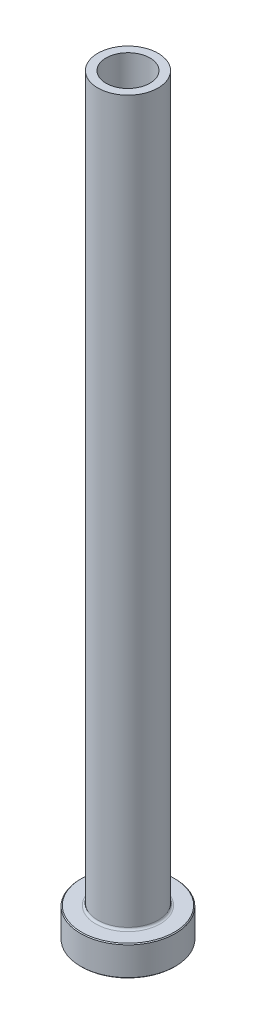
ISO-10303-21;
HEADER;
FILE_DESCRIPTION(('STEP AP214'),'2;1');
FILE_NAME('part.step','',(''),(''),'','','');
FILE_SCHEMA(('AUTOMOTIVE_DESIGN { 1 0 10303 214 1 1 1 1 }'));
ENDSEC;
DATA;
#1=APPLICATION_CONTEXT('core data for automotive mechanical design processes');
#2=APPLICATION_PROTOCOL_DEFINITION('international standard','automotive_design',2000,#1);
#3=PRODUCT_CONTEXT('',#1,'mechanical');
#4=PRODUCT('Part','Part','',(#3));
#5=PRODUCT_RELATED_PRODUCT_CATEGORY('part','',(#4));
#6=PRODUCT_DEFINITION_FORMATION('','',#4);
#7=PRODUCT_DEFINITION_CONTEXT('part definition',#1,'design');
#8=PRODUCT_DEFINITION('design','',#6,#7);
#9=PRODUCT_DEFINITION_SHAPE('','',#8);
#10=(LENGTH_UNIT() NAMED_UNIT(*) SI_UNIT(.MILLI.,.METRE.));
#11=(NAMED_UNIT(*) PLANE_ANGLE_UNIT() SI_UNIT($,.RADIAN.));
#12=(NAMED_UNIT(*) SI_UNIT($,.STERADIAN.) SOLID_ANGLE_UNIT());
#13=UNCERTAINTY_MEASURE_WITH_UNIT(LENGTH_MEASURE(1.E-05),#10,'distance_accuracy_value','');
#14=(GEOMETRIC_REPRESENTATION_CONTEXT(3) GLOBAL_UNCERTAINTY_ASSIGNED_CONTEXT((#13)) GLOBAL_UNIT_ASSIGNED_CONTEXT((#10,
#11,#12)) REPRESENTATION_CONTEXT('',''));
#15=CARTESIAN_POINT('',(0.,0.,0.));
#16=DIRECTION('',(0.,0.,1.));
#17=DIRECTION('',(1.,0.,0.));
#18=AXIS2_PLACEMENT_3D('',#15,#16,#17);
#19=CARTESIAN_POINT('',(0.,92.1876809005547,0.));
#20=DIRECTION('',(0.,1.,0.));
#21=DIRECTION('',(0.,0.,1.));
#22=AXIS2_PLACEMENT_3D('',#19,#20,#21);
#23=CYLINDRICAL_SURFACE('',#22,5.1);
#24=CARTESIAN_POINT('',(0.,175.,0.));
#25=DIRECTION('',(0.,1.,0.));
#26=DIRECTION('',(0.,0.,1.));
#27=AXIS2_PLACEMENT_3D('',#24,#25,#26);
#28=CIRCLE('',#27,5.1);
#29=CARTESIAN_POINT('',(0.,175.,5.1));
#30=VERTEX_POINT('',#29);
#31=EDGE_CURVE('E62',#30,#30,#28,.T.);
#32=ORIENTED_EDGE('',*,*,#31,.T.);
#33=EDGE_LOOP('',(#32));
#34=FACE_BOUND('',#33,.T.);
#35=CARTESIAN_POINT('',(0.,120.,0.));
#36=DIRECTION('',(0.,1.,0.));
#37=DIRECTION('',(0.,0.,1.));
#38=AXIS2_PLACEMENT_3D('',#35,#36,#37);
#39=CIRCLE('',#38,5.1);
#40=CARTESIAN_POINT('',(0.,120.,5.1));
#41=VERTEX_POINT('',#40);
#42=EDGE_CURVE('E71',#41,#41,#39,.T.);
#43=ORIENTED_EDGE('',*,*,#42,.F.);
#44=EDGE_LOOP('',(#43));
#45=FACE_BOUND('',#44,.T.);
#46=ADVANCED_FACE('F30',(#34,#45),#23,.F.);
#47=CARTESIAN_POINT('',(-5.1,175.,0.));
#48=DIRECTION('',(0.,1.,0.));
#49=DIRECTION('',(0.,0.,1.));
#50=AXIS2_PLACEMENT_3D('',#47,#48,#49);
#51=PLANE('',#50);
#52=CARTESIAN_POINT('',(0.,175.,0.));
#53=DIRECTION('',(0.,1.,0.));
#54=DIRECTION('',(0.,0.,1.));
#55=AXIS2_PLACEMENT_3D('',#52,#53,#54);
#56=CIRCLE('',#55,7.00000000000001);
#57=CARTESIAN_POINT('',(0.,175.,7.00000000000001));
#58=VERTEX_POINT('',#57);
#59=EDGE_CURVE('E65',#58,#58,#56,.T.);
#60=ORIENTED_EDGE('',*,*,#59,.T.);
#61=EDGE_LOOP('',(#60));
#62=FACE_BOUND('',#61,.T.);
#63=ORIENTED_EDGE('',*,*,#31,.F.);
#64=EDGE_LOOP('',(#63));
#65=FACE_BOUND('',#64,.T.);
#66=ADVANCED_FACE('F79',(#62,#65),#51,.T.);
#67=CARTESIAN_POINT('',(0.,92.1876809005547,0.));
#68=DIRECTION('',(0.,1.,0.));
#69=DIRECTION('',(0.,0.,1.));
#70=AXIS2_PLACEMENT_3D('',#67,#68,#69);
#71=CYLINDRICAL_SURFACE('',#70,7.);
#72=CARTESIAN_POINT('',(0.,7.50000000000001,0.));
#73=DIRECTION('',(0.,1.,0.));
#74=DIRECTION('',(0.,0.,1.));
#75=AXIS2_PLACEMENT_3D('',#72,#73,#74);
#76=CIRCLE('',#75,7.);
#77=CARTESIAN_POINT('',(0.,7.50000000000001,7.));
#78=VERTEX_POINT('',#77);
#79=EDGE_CURVE('E59',#78,#78,#76,.T.);
#80=ORIENTED_EDGE('',*,*,#79,.T.);
#81=EDGE_LOOP('',(#80));
#82=FACE_BOUND('',#81,.T.);
#83=ORIENTED_EDGE('',*,*,#59,.F.);
#84=EDGE_LOOP('',(#83));
#85=FACE_BOUND('',#84,.T.);
#86=ADVANCED_FACE('F85',(#82,#85),#71,.T.);
#87=CARTESIAN_POINT('',(-6.99999999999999,7.,0.));
#88=DIRECTION('',(0.,1.,0.));
#89=DIRECTION('',(0.,0.,1.));
#90=AXIS2_PLACEMENT_3D('',#87,#88,#89);
#91=PLANE('',#90);
#92=CARTESIAN_POINT('',(0.,7.,0.));
#93=DIRECTION('',(0.,1.,0.));
#94=DIRECTION('',(0.,0.,1.));
#95=AXIS2_PLACEMENT_3D('',#92,#93,#94);
#96=CIRCLE('',#95,10.8);
#97=CARTESIAN_POINT('',(0.,7.,10.8));
#98=VERTEX_POINT('',#97);
#99=EDGE_CURVE('E53',#98,#98,#96,.T.);
#100=ORIENTED_EDGE('',*,*,#99,.T.);
#101=EDGE_LOOP('',(#100));
#102=FACE_BOUND('',#101,.T.);
#103=CARTESIAN_POINT('',(0.,7.,0.));
#104=DIRECTION('',(0.,1.,0.));
#105=DIRECTION('',(0.,0.,1.));
#106=AXIS2_PLACEMENT_3D('',#103,#104,#105);
#107=CIRCLE('',#106,7.5);
#108=CARTESIAN_POINT('',(0.,7.,7.5));
#109=VERTEX_POINT('',#108);
#110=EDGE_CURVE('E56',#109,#109,#107,.F.);
#111=ORIENTED_EDGE('',*,*,#110,.T.);
#112=EDGE_LOOP('',(#111));
#113=FACE_BOUND('',#112,.T.);
#114=ADVANCED_FACE('F111',(#102,#113),#91,.T.);
#115=CARTESIAN_POINT('',(0.,92.1876809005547,0.));
#116=DIRECTION('',(0.,1.,0.));
#117=DIRECTION('',(0.,0.,1.));
#118=AXIS2_PLACEMENT_3D('',#115,#116,#117);
#119=CYLINDRICAL_SURFACE('',#118,11.);
#120=CARTESIAN_POINT('',(0.,6.8,0.));
#121=DIRECTION('',(0.,1.,0.));
#122=DIRECTION('',(0.,0.,1.));
#123=AXIS2_PLACEMENT_3D('',#120,#121,#122);
#124=CIRCLE('',#123,11.);
#125=CARTESIAN_POINT('',(0.,6.8,11.));
#126=VERTEX_POINT('',#125);
#127=EDGE_CURVE('E45',#126,#126,#124,.F.);
#128=ORIENTED_EDGE('',*,*,#127,.T.);
#129=EDGE_LOOP('',(#128));
#130=FACE_BOUND('',#129,.T.);
#131=CARTESIAN_POINT('',(0.,0.199999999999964,0.));
#132=DIRECTION('',(0.,-1.,0.));
#133=DIRECTION('',(0.,0.,-1.));
#134=AXIS2_PLACEMENT_3D('',#131,#132,#133);
#135=CIRCLE('',#134,11.);
#136=CARTESIAN_POINT('',(0.,0.199999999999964,-11.));
#137=VERTEX_POINT('',#136);
#138=EDGE_CURVE('E50',#137,#137,#135,.F.);
#139=ORIENTED_EDGE('',*,*,#138,.T.);
#140=EDGE_LOOP('',(#139));
#141=FACE_BOUND('',#140,.T.);
#142=ADVANCED_FACE('F108',(#130,#141),#119,.T.);
#143=CARTESIAN_POINT('',(-11.,0.,0.));
#144=DIRECTION('',(0.,-1.,0.));
#145=DIRECTION('',(0.,0.,-1.));
#146=AXIS2_PLACEMENT_3D('',#143,#144,#145);
#147=PLANE('',#146);
#148=CARTESIAN_POINT('',(0.,0.,0.));
#149=DIRECTION('',(0.,-1.,0.));
#150=DIRECTION('',(0.,0.,-1.));
#151=AXIS2_PLACEMENT_3D('',#148,#149,#150);
#152=CIRCLE('',#151,5.84999999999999);
#153=CARTESIAN_POINT('',(0.,0.,-5.84999999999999));
#154=VERTEX_POINT('',#153);
#155=EDGE_CURVE('E37',#154,#154,#152,.F.);
#156=ORIENTED_EDGE('',*,*,#155,.T.);
#157=EDGE_LOOP('',(#156));
#158=FACE_BOUND('',#157,.T.);
#159=CARTESIAN_POINT('',(0.,0.,0.));
#160=DIRECTION('',(0.,-1.,0.));
#161=DIRECTION('',(0.,0.,-1.));
#162=AXIS2_PLACEMENT_3D('',#159,#160,#161);
#163=CIRCLE('',#162,10.8);
#164=CARTESIAN_POINT('',(0.,0.,-10.8));
#165=VERTEX_POINT('',#164);
#166=EDGE_CURVE('E41',#165,#165,#163,.T.);
#167=ORIENTED_EDGE('',*,*,#166,.T.);
#168=EDGE_LOOP('',(#167));
#169=FACE_BOUND('',#168,.T.);
#170=ADVANCED_FACE('F110',(#158,#169),#147,.T.);
#171=CARTESIAN_POINT('',(0.,92.1876809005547,0.));
#172=DIRECTION('',(0.,1.,0.));
#173=DIRECTION('',(0.,0.,1.));
#174=AXIS2_PLACEMENT_3D('',#171,#172,#173);
#175=CYLINDRICAL_SURFACE('',#174,5.35);
#176=CARTESIAN_POINT('',(0.,0.499999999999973,0.));
#177=DIRECTION('',(0.,-1.,0.));
#178=DIRECTION('',(0.,0.,-1.));
#179=AXIS2_PLACEMENT_3D('',#176,#177,#178);
#180=CIRCLE('',#179,5.35);
#181=CARTESIAN_POINT('',(0.,0.499999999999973,-5.35));
#182=VERTEX_POINT('',#181);
#183=EDGE_CURVE('E10',#182,#182,#180,.T.);
#184=ORIENTED_EDGE('',*,*,#183,.T.);
#185=EDGE_LOOP('',(#184));
#186=FACE_BOUND('',#185,.T.);
#187=CARTESIAN_POINT('',(0.,108.,0.));
#188=DIRECTION('',(0.,1.,0.));
#189=DIRECTION('',(0.,0.,1.));
#190=AXIS2_PLACEMENT_3D('',#187,#188,#189);
#191=CIRCLE('',#190,5.35);
#192=CARTESIAN_POINT('',(0.,108.,5.35));
#193=VERTEX_POINT('',#192);
#194=EDGE_CURVE('E68',#193,#193,#191,.T.);
#195=ORIENTED_EDGE('',*,*,#194,.T.);
#196=EDGE_LOOP('',(#195));
#197=FACE_BOUND('',#196,.T.);
#198=ADVANCED_FACE('F118',(#186,#197),#175,.F.);
#199=CARTESIAN_POINT('',(0.,108.,0.));
#200=DIRECTION('',(0.,-1.,0.));
#201=DIRECTION('',(0.,0.,-1.));
#202=AXIS2_PLACEMENT_3D('',#199,#200,#201);
#203=CONICAL_SURFACE('',#202,5.35,0.0208303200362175);
#204=ORIENTED_EDGE('',*,*,#42,.T.);
#205=EDGE_LOOP('',(#204));
#206=FACE_BOUND('',#205,.T.);
#207=ORIENTED_EDGE('',*,*,#194,.F.);
#208=EDGE_LOOP('',(#207));
#209=FACE_BOUND('',#208,.T.);
#210=ADVANCED_FACE('F75',(#206,#209),#203,.F.);
#211=CARTESIAN_POINT('',(0.,7.50000000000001,0.));
#212=DIRECTION('',(0.,1.,0.));
#213=DIRECTION('',(0.,0.,1.));
#214=AXIS2_PLACEMENT_3D('',#211,#212,#213);
#215=TOROIDAL_SURFACE('',#214,7.5,0.5);
#216=ORIENTED_EDGE('',*,*,#110,.F.);
#217=EDGE_LOOP('',(#216));
#218=FACE_BOUND('',#217,.T.);
#219=ORIENTED_EDGE('',*,*,#79,.F.);
#220=EDGE_LOOP('',(#219));
#221=FACE_BOUND('',#220,.T.);
#222=ADVANCED_FACE('F90',(#218,#221),#215,.F.);
#223=CARTESIAN_POINT('',(0.,7.00000000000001,0.));
#224=DIRECTION('',(0.,-1.,0.));
#225=DIRECTION('',(0.,0.,-1.));
#226=AXIS2_PLACEMENT_3D('',#223,#224,#225);
#227=CONICAL_SURFACE('',#226,10.8,0.785398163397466);
#228=ORIENTED_EDGE('',*,*,#127,.F.);
#229=EDGE_LOOP('',(#228));
#230=FACE_BOUND('',#229,.T.);
#231=ORIENTED_EDGE('',*,*,#99,.F.);
#232=EDGE_LOOP('',(#231));
#233=FACE_BOUND('',#232,.T.);
#234=ADVANCED_FACE('F93',(#230,#233),#227,.T.);
#235=CARTESIAN_POINT('',(0.,0.199999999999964,0.));
#236=DIRECTION('',(0.,1.,0.));
#237=DIRECTION('',(0.,0.,1.));
#238=AXIS2_PLACEMENT_3D('',#235,#236,#237);
#239=CONICAL_SURFACE('',#238,11.,0.785398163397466);
#240=ORIENTED_EDGE('',*,*,#166,.F.);
#241=EDGE_LOOP('',(#240));
#242=FACE_BOUND('',#241,.T.);
#243=ORIENTED_EDGE('',*,*,#138,.F.);
#244=EDGE_LOOP('',(#243));
#245=FACE_BOUND('',#244,.T.);
#246=ADVANCED_FACE('F96',(#242,#245),#239,.T.);
#247=CARTESIAN_POINT('',(0.,0.,0.));
#248=DIRECTION('',(0.,-1.,0.));
#249=DIRECTION('',(0.,0.,-1.));
#250=AXIS2_PLACEMENT_3D('',#247,#248,#249);
#251=CONICAL_SURFACE('',#250,5.84999999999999,0.785398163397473);
#252=ORIENTED_EDGE('',*,*,#183,.F.);
#253=EDGE_LOOP('',(#252));
#254=FACE_BOUND('',#253,.T.);
#255=ORIENTED_EDGE('',*,*,#155,.F.);
#256=EDGE_LOOP('',(#255));
#257=FACE_BOUND('',#256,.T.);
#258=ADVANCED_FACE('F32',(#254,#257),#251,.F.);
#259=CLOSED_SHELL('',(#46,#66,#86,#114,#142,#170,#198,#210,#222,#234,#246,#258));
#260=MANIFOLD_SOLID_BREP('B2',#259);
#261=ADVANCED_BREP_SHAPE_REPRESENTATION('',(#18,#260),#14);
#262=SHAPE_DEFINITION_REPRESENTATION(#9,#261);
ENDSEC;
END-ISO-10303-21;
